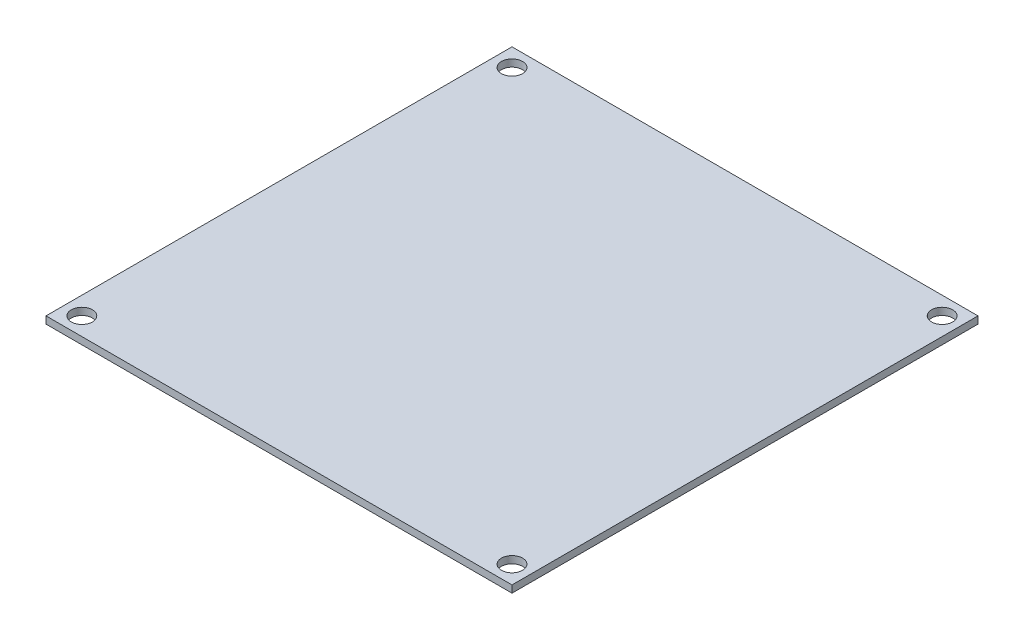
from build123d import *

# Parameters (mm, degrees)
SKETCH1_W             = 65
SKETCH1_H             = 65
BOSS_EXTRUDE1_DEPTH   = 1
F_4_CLEARANCE_HOLE1_D = 2.9464


with BuildPart() as part:
    # Sketch1 → Boss-Extrude1 (new body)
    with BuildSketch(Plane(origin=(0, 0, 0), x_dir=(1, 0, 0), z_dir=(0, 1, 0))):
        with Locations((32.5, 32.5)):
            Rectangle(SKETCH1_W, SKETCH1_H)
    extrude(amount=BOSS_EXTRUDE1_DEPTH)

    # 4 Clearance Hole1 (through all)
    with Locations(Plane(origin=(2.5, 1, -62.5), x_dir=(0, 0, 1), z_dir=(0, 1, 0))):
        with Locations((0, 0), (0, 60), (60, 60), (60, 0)):
            Hole(F_4_CLEARANCE_HOLE1_D / 2)


solid = part.part
